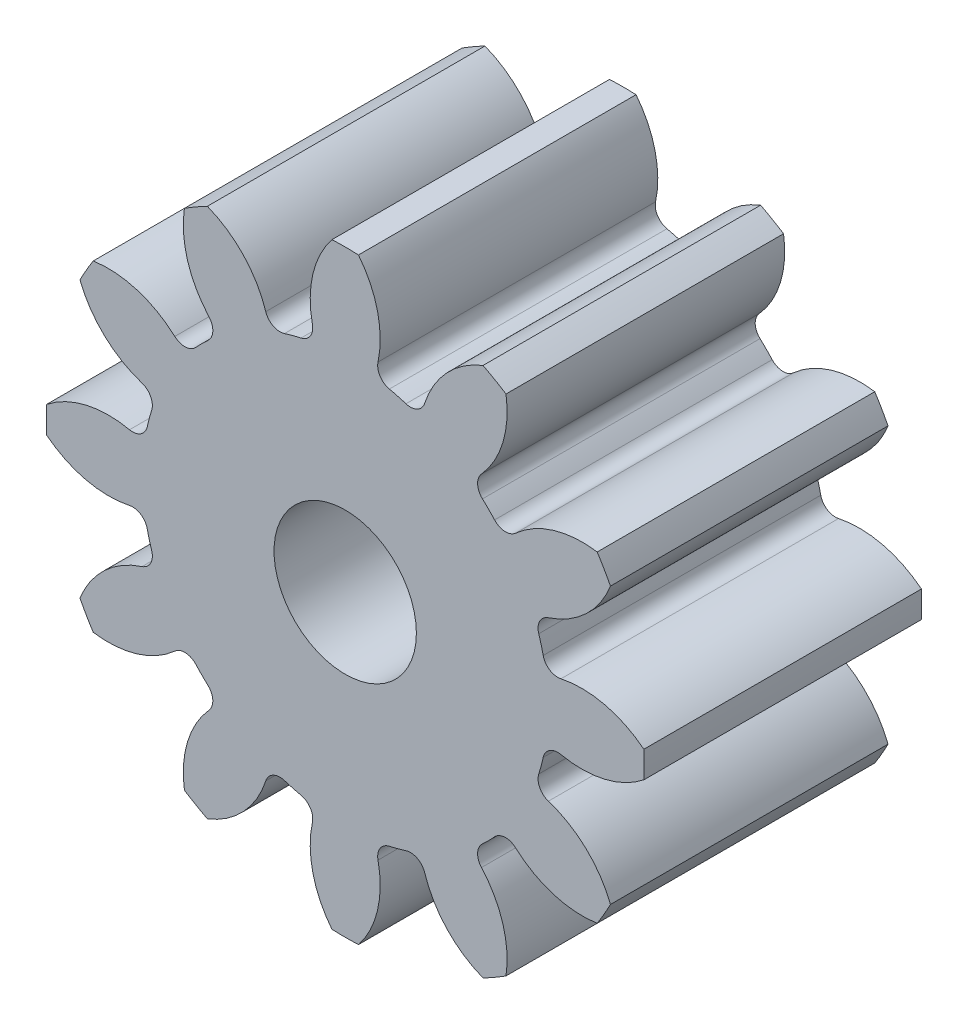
from build123d import *

# Parameters (mm, degrees)
BOSS_EXTRU_1_DEPTH                 = 3.9
CONG_1_R                           = 0.21
R_P_TITION_CIRCULAIRE4_COUNT       = 12
CONG_1_OF_R_P_TITION_CIRCULAIRE4_R = 0.21
ESQUISSE10_R                       = 1
ENL_V_MAT_EXTRU_4_DEPTH            = 9.30619824


with BuildPart() as part:
    # Esquisse3 → Boss.-Extru.1 (new body)
    with BuildSketch(Plane.XY):
        with BuildLine():
            Line((-2.116341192, 2.192536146), (-1.378706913, -0.560352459))
            Line((-1.378706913, -0.560352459), (-0.641072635, 2.192536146))
            ThreePointArc((-0.641072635, 2.192536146), (-0.809409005, 2.23220907), (-0.979841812, 2.261598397))
            ThreePointArc((-0.979841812, 2.261598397), (-0.903476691, 2.976835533), (-1.192498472, 3.635517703))
            ThreePointArc((-1.192498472, 3.635517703), (-1.378706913, 3.639647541), (-1.564915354, 3.635517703))
            ThreePointArc((-1.564915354, 3.635517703), (-1.853937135, 2.976835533), (-1.777572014, 2.261598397))
            ThreePointArc((-1.777572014, 2.261598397), (-1.948004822, 2.23220907), (-2.116341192, 2.192536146))
        make_face()
    boss_extru_1 = extrude(amount=BOSS_EXTRU_1_DEPTH)

    # Cong_1
    cong_1_edges = [part.edges().sort_by_distance(p)[0] for p in [
        (-1.777572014, 2.261598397, 1.95),
        (-0.979841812, 2.261598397, 1.95),
    ]]
    fillet(cong_1_edges, radius=CONG_1_R)

    # R_p_tition circulaire4: Boss.-Extru.1 ×12 about axis
    r_p_tition_circulaire4_axis = Axis((-1.378706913, -0.560352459, 0), (0, 0, 1))
    for i in range(1, R_P_TITION_CIRCULAIRE4_COUNT):
        add(boss_extru_1.rotate(r_p_tition_circulaire4_axis, i * 360 / R_P_TITION_CIRCULAIRE4_COUNT))

    # Cong_1 of R_p_tition circulaire4
    cong_1_of_r_p_tition_circulaire4_edges = [part.edges().sort_by_distance(p)[0] for p in [
        (-3.135109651, 1.68409612, 1.95),
        (-2.444255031, 2.082961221, 1.95),
        (-4.022020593, 0.505195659, 1.95),
        (-3.623155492, 1.196050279, 1.95),
        (-4.200657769, -0.959217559, 1.95),
        (-4.200657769, -0.161487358, 1.95),
        (-3.623155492, -2.316755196, 1.95),
        (-4.022020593, -1.625900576, 1.95),
        (-2.444255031, -3.203666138, 1.95),
        (-3.135109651, -2.804801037, 1.95),
        (-0.979841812, -3.382303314, 1.95),
        (-1.777572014, -3.382303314, 1.95),
        (0.377695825, -2.804801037, 1.95),
        (-0.313158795, -3.203666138, 1.95),
        (1.264606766, -1.625900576, 1.95),
        (0.865741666, -2.316755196, 1.95),
        (1.443243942, -0.161487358, 1.95),
        (1.443243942, -0.959217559, 1.95),
        (0.865741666, 1.196050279, 1.95),
        (1.264606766, 0.505195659, 1.95),
        (-0.313158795, 2.082961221, 1.95),
        (0.377695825, 1.68409612, 1.95),
    ]]
    fillet(cong_1_of_r_p_tition_circulaire4_edges, radius=CONG_1_OF_R_P_TITION_CIRCULAIRE4_R)

    # Esquisse10 → Enl_v. mat.-Extru.4 (cut, through all)
    with BuildSketch(Plane.XY):
        with Locations((-1.378706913, -0.560352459)):
            Circle(ESQUISSE10_R)
    extrude(amount=ENL_V_MAT_EXTRU_4_DEPTH, mode=Mode.SUBTRACT)


solid = part.part
